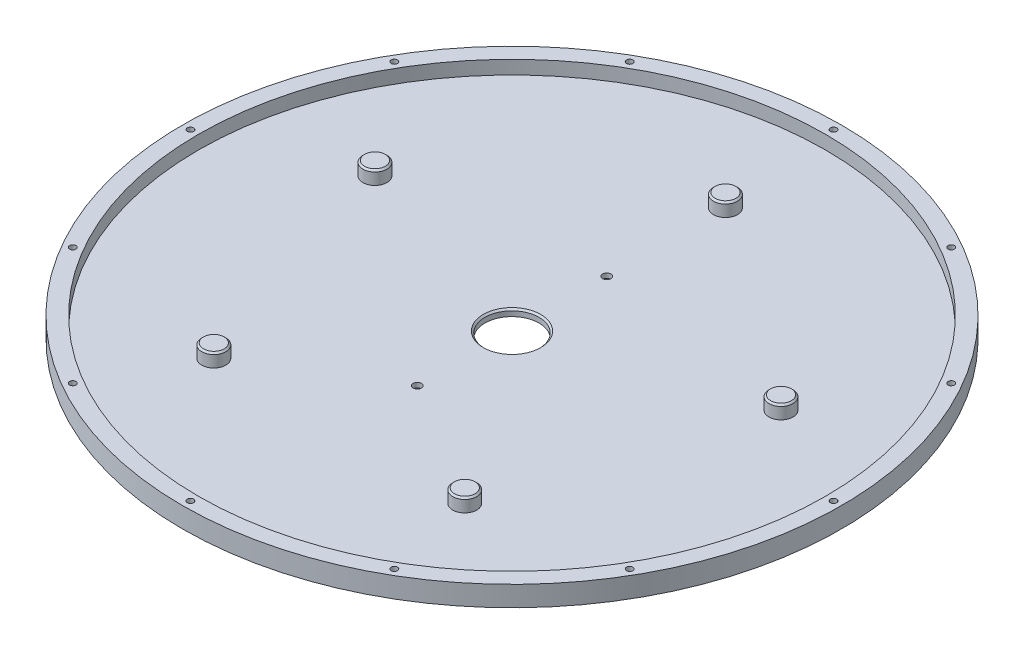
ISO-10303-21;
HEADER;
FILE_DESCRIPTION(('STEP AP214'),'2;1');
FILE_NAME('part.step','',(''),(''),'','','');
FILE_SCHEMA(('AUTOMOTIVE_DESIGN { 1 0 10303 214 1 1 1 1 }'));
ENDSEC;
DATA;
#1=APPLICATION_CONTEXT('core data for automotive mechanical design processes');
#2=APPLICATION_PROTOCOL_DEFINITION('international standard','automotive_design',2000,#1);
#3=PRODUCT_CONTEXT('',#1,'mechanical');
#4=PRODUCT('Part','Part','',(#3));
#5=PRODUCT_RELATED_PRODUCT_CATEGORY('part','',(#4));
#6=PRODUCT_DEFINITION_FORMATION('','',#4);
#7=PRODUCT_DEFINITION_CONTEXT('part definition',#1,'design');
#8=PRODUCT_DEFINITION('design','',#6,#7);
#9=PRODUCT_DEFINITION_SHAPE('','',#8);
#10=(LENGTH_UNIT() NAMED_UNIT(*) SI_UNIT(.MILLI.,.METRE.));
#11=(NAMED_UNIT(*) PLANE_ANGLE_UNIT() SI_UNIT($,.RADIAN.));
#12=(NAMED_UNIT(*) SI_UNIT($,.STERADIAN.) SOLID_ANGLE_UNIT());
#13=UNCERTAINTY_MEASURE_WITH_UNIT(LENGTH_MEASURE(1.E-05),#10,'distance_accuracy_value','');
#14=(GEOMETRIC_REPRESENTATION_CONTEXT(3) GLOBAL_UNCERTAINTY_ASSIGNED_CONTEXT((#13)) GLOBAL_UNIT_ASSIGNED_CONTEXT((#10,
#11,#12)) REPRESENTATION_CONTEXT('',''));
#15=CARTESIAN_POINT('',(0.,0.,0.));
#16=DIRECTION('',(0.,0.,1.));
#17=DIRECTION('',(1.,0.,0.));
#18=AXIS2_PLACEMENT_3D('',#15,#16,#17);
#19=CARTESIAN_POINT('',(0.,-6.35,0.));
#20=DIRECTION('',(0.,-1.,0.));
#21=DIRECTION('',(0.,0.,-1.));
#22=AXIS2_PLACEMENT_3D('',#19,#20,#21);
#23=PLANE('',#22);
#24=CARTESIAN_POINT('',(0.,-6.34999999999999,-45.085));
#25=DIRECTION('',(0.,-1.,0.));
#26=DIRECTION('',(0.,0.,-1.));
#27=AXIS2_PLACEMENT_3D('',#24,#25,#26);
#28=CIRCLE('',#27,1.9685);
#29=CARTESIAN_POINT('',(0.,-6.34999999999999,-47.0535));
#30=VERTEX_POINT('',#29);
#31=EDGE_CURVE('E388',#30,#30,#28,.T.);
#32=ORIENTED_EDGE('',*,*,#31,.T.);
#33=EDGE_LOOP('',(#32));
#34=FACE_BOUND('',#33,.T.);
#35=CARTESIAN_POINT('',(0.,-6.35000000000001,45.085));
#36=DIRECTION('',(0.,-1.,0.));
#37=DIRECTION('',(0.,0.,-1.));
#38=AXIS2_PLACEMENT_3D('',#35,#36,#37);
#39=CIRCLE('',#38,1.9685);
#40=CARTESIAN_POINT('',(0.,-6.35000000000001,43.1165));
#41=VERTEX_POINT('',#40);
#42=EDGE_CURVE('E391',#41,#41,#39,.T.);
#43=ORIENTED_EDGE('',*,*,#42,.T.);
#44=EDGE_LOOP('',(#43));
#45=FACE_BOUND('',#44,.T.);
#46=CARTESIAN_POINT('',(0.,-6.35,0.));
#47=DIRECTION('',(0.,-1.,0.));
#48=DIRECTION('',(0.,0.,-1.));
#49=AXIS2_PLACEMENT_3D('',#46,#47,#48);
#50=CIRCLE('',#49,13.674725);
#51=CARTESIAN_POINT('',(0.,-6.35,-13.674725));
#52=VERTEX_POINT('',#51);
#53=EDGE_CURVE('E253',#52,#52,#50,.T.);
#54=ORIENTED_EDGE('',*,*,#53,.T.);
#55=EDGE_LOOP('',(#54));
#56=FACE_BOUND('',#55,.T.);
#57=CARTESIAN_POINT('',(-96.6273420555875,-6.34999999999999,-31.3961266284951));
#58=DIRECTION('',(0.,-1.,0.));
#59=DIRECTION('',(0.,0.,-1.));
#60=AXIS2_PLACEMENT_3D('',#57,#58,#59);
#61=CIRCLE('',#60,5.71499999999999);
#62=CARTESIAN_POINT('',(-96.6273420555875,-6.34999999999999,-37.111126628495));
#63=VERTEX_POINT('',#62);
#64=EDGE_CURVE('E301',#63,#63,#61,.T.);
#65=ORIENTED_EDGE('',*,*,#64,.T.);
#66=EDGE_LOOP('',(#65));
#67=FACE_BOUND('',#66,.T.);
#68=CARTESIAN_POINT('',(-59.718981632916,-6.35000000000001,82.1961266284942));
#69=DIRECTION('',(0.,-1.,0.));
#70=DIRECTION('',(0.,0.,-1.));
#71=AXIS2_PLACEMENT_3D('',#68,#69,#70);
#72=CIRCLE('',#71,5.715);
#73=CARTESIAN_POINT('',(-59.718981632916,-6.35000000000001,76.4811266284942));
#74=VERTEX_POINT('',#73);
#75=EDGE_CURVE('E298',#74,#74,#72,.F.);
#76=ORIENTED_EDGE('',*,*,#75,.F.);
#77=EDGE_LOOP('',(#76));
#78=FACE_BOUND('',#77,.T.);
#79=CARTESIAN_POINT('',(59.7189816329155,-6.35000000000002,82.1961266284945));
#80=DIRECTION('',(0.,-1.,0.));
#81=DIRECTION('',(0.,0.,-1.));
#82=AXIS2_PLACEMENT_3D('',#79,#80,#81);
#83=CIRCLE('',#82,5.715);
#84=CARTESIAN_POINT('',(59.7189816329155,-6.35000000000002,76.4811266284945));
#85=VERTEX_POINT('',#84);
#86=EDGE_CURVE('E295',#85,#85,#83,.F.);
#87=ORIENTED_EDGE('',*,*,#86,.F.);
#88=EDGE_LOOP('',(#87));
#89=FACE_BOUND('',#88,.T.);
#90=CARTESIAN_POINT('',(96.6273420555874,-6.35,-31.3961266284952));
#91=DIRECTION('',(0.,-1.,0.));
#92=DIRECTION('',(0.,0.,-1.));
#93=AXIS2_PLACEMENT_3D('',#90,#91,#92);
#94=CIRCLE('',#93,5.71499999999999);
#95=CARTESIAN_POINT('',(96.6273420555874,-6.35,-37.1111266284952));
#96=VERTEX_POINT('',#95);
#97=EDGE_CURVE('E292',#96,#96,#94,.F.);
#98=ORIENTED_EDGE('',*,*,#97,.F.);
#99=EDGE_LOOP('',(#98));
#100=FACE_BOUND('',#99,.T.);
#101=CARTESIAN_POINT('',(0.,-6.34999999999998,-101.6));
#102=DIRECTION('',(0.,-1.,0.));
#103=DIRECTION('',(0.,0.,-1.));
#104=AXIS2_PLACEMENT_3D('',#101,#102,#103);
#105=CIRCLE('',#104,5.715);
#106=CARTESIAN_POINT('',(0.,-6.34999999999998,-107.315));
#107=VERTEX_POINT('',#106);
#108=EDGE_CURVE('E289',#107,#107,#105,.F.);
#109=ORIENTED_EDGE('',*,*,#108,.F.);
#110=EDGE_LOOP('',(#109));
#111=FACE_BOUND('',#110,.T.);
#112=CARTESIAN_POINT('',(0.,-6.35,0.));
#113=DIRECTION('',(0.,-1.,0.));
#114=DIRECTION('',(0.,0.,-1.));
#115=AXIS2_PLACEMENT_3D('',#112,#113,#114);
#116=CIRCLE('',#115,149.225);
#117=CARTESIAN_POINT('',(0.,-6.34999999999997,-149.225));
#118=VERTEX_POINT('',#117);
#119=EDGE_CURVE('E286',#118,#118,#116,.T.);
#120=ORIENTED_EDGE('',*,*,#119,.F.);
#121=EDGE_LOOP('',(#120));
#122=FACE_BOUND('',#121,.T.);
#123=ADVANCED_FACE('F229',(#34,#45,#56,#67,#78,#89,#100,#111,#122),#23,.F.);
#124=CARTESIAN_POINT('',(-96.6273420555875,-6.34999999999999,-31.3961266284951));
#125=DIRECTION('',(0.,1.,0.));
#126=DIRECTION('',(0.,0.,1.));
#127=AXIS2_PLACEMENT_3D('',#124,#125,#126);
#128=CYLINDRICAL_SURFACE('',#127,5.71499999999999);
#129=CARTESIAN_POINT('',(-96.6273420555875,-0.793750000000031,-31.3961266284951));
#130=DIRECTION('',(0.,-1.,0.));
#131=DIRECTION('',(0.,0.,-1.));
#132=AXIS2_PLACEMENT_3D('',#129,#130,#131);
#133=CIRCLE('',#132,5.71499999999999);
#134=CARTESIAN_POINT('',(-96.6273420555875,-0.793750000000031,-37.111126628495));
#135=VERTEX_POINT('',#134);
#136=EDGE_CURVE('E277',#135,#135,#133,.T.);
#137=ORIENTED_EDGE('',*,*,#136,.T.);
#138=EDGE_LOOP('',(#137));
#139=FACE_BOUND('',#138,.T.);
#140=ORIENTED_EDGE('',*,*,#64,.F.);
#141=EDGE_LOOP('',(#140));
#142=FACE_BOUND('',#141,.T.);
#143=ADVANCED_FACE('F415',(#139,#142),#128,.T.);
#144=CARTESIAN_POINT('',(-96.6273420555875,0.,-31.3961266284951));
#145=DIRECTION('',(0.,-1.,0.));
#146=DIRECTION('',(0.,0.,-1.));
#147=AXIS2_PLACEMENT_3D('',#144,#145,#146);
#148=PLANE('',#147);
#149=CARTESIAN_POINT('',(-96.6273420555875,0.,-31.3961266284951));
#150=DIRECTION('',(0.,-1.,0.));
#151=DIRECTION('',(0.,0.,-1.));
#152=AXIS2_PLACEMENT_3D('',#149,#150,#151);
#153=CIRCLE('',#152,4.92124999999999);
#154=CARTESIAN_POINT('',(-96.6273420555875,0.,-36.317376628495));
#155=VERTEX_POINT('',#154);
#156=EDGE_CURVE('E274',#155,#155,#153,.F.);
#157=ORIENTED_EDGE('',*,*,#156,.T.);
#158=EDGE_LOOP('',(#157));
#159=FACE_BOUND('',#158,.T.);
#160=ADVANCED_FACE('F421',(#159),#148,.F.);
#161=CARTESIAN_POINT('',(-59.718981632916,-6.35000000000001,82.1961266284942));
#162=DIRECTION('',(0.,1.,0.));
#163=DIRECTION('',(0.,0.,1.));
#164=AXIS2_PLACEMENT_3D('',#161,#162,#163);
#165=CYLINDRICAL_SURFACE('',#164,5.715);
#166=CARTESIAN_POINT('',(-59.718981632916,-0.793750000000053,82.1961266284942));
#167=DIRECTION('',(0.,-1.,0.));
#168=DIRECTION('',(0.,0.,-1.));
#169=AXIS2_PLACEMENT_3D('',#166,#167,#168);
#170=CIRCLE('',#169,5.715);
#171=CARTESIAN_POINT('',(-59.718981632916,-0.793750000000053,76.4811266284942));
#172=VERTEX_POINT('',#171);
#173=EDGE_CURVE('E271',#172,#172,#170,.T.);
#174=ORIENTED_EDGE('',*,*,#173,.T.);
#175=EDGE_LOOP('',(#174));
#176=FACE_BOUND('',#175,.T.);
#177=ORIENTED_EDGE('',*,*,#75,.T.);
#178=EDGE_LOOP('',(#177));
#179=FACE_BOUND('',#178,.T.);
#180=ADVANCED_FACE('F484',(#176,#179),#165,.T.);
#181=CARTESIAN_POINT('',(-59.718981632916,0.,82.1961266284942));
#182=DIRECTION('',(0.,-1.,0.));
#183=DIRECTION('',(0.,0.,-1.));
#184=AXIS2_PLACEMENT_3D('',#181,#182,#183);
#185=PLANE('',#184);
#186=CARTESIAN_POINT('',(-59.718981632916,0.,82.1961266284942));
#187=DIRECTION('',(0.,-1.,0.));
#188=DIRECTION('',(0.,0.,-1.));
#189=AXIS2_PLACEMENT_3D('',#186,#187,#188);
#190=CIRCLE('',#189,4.92124999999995);
#191=CARTESIAN_POINT('',(-59.718981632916,0.,77.2748766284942));
#192=VERTEX_POINT('',#191);
#193=EDGE_CURVE('E268',#192,#192,#190,.F.);
#194=ORIENTED_EDGE('',*,*,#193,.T.);
#195=EDGE_LOOP('',(#194));
#196=FACE_BOUND('',#195,.T.);
#197=ADVANCED_FACE('F600',(#196),#185,.F.);
#198=CARTESIAN_POINT('',(59.7189816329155,-6.35000000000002,82.1961266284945));
#199=DIRECTION('',(0.,1.,0.));
#200=DIRECTION('',(0.,0.,1.));
#201=AXIS2_PLACEMENT_3D('',#198,#199,#200);
#202=CYLINDRICAL_SURFACE('',#201,5.715);
#203=CARTESIAN_POINT('',(59.7189816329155,-0.793750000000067,82.1961266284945));
#204=DIRECTION('',(0.,-1.,0.));
#205=DIRECTION('',(0.,0.,-1.));
#206=AXIS2_PLACEMENT_3D('',#203,#204,#205);
#207=CIRCLE('',#206,5.715);
#208=CARTESIAN_POINT('',(59.7189816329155,-0.793750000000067,76.4811266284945));
#209=VERTEX_POINT('',#208);
#210=EDGE_CURVE('E265',#209,#209,#207,.T.);
#211=ORIENTED_EDGE('',*,*,#210,.T.);
#212=EDGE_LOOP('',(#211));
#213=FACE_BOUND('',#212,.T.);
#214=ORIENTED_EDGE('',*,*,#86,.T.);
#215=EDGE_LOOP('',(#214));
#216=FACE_BOUND('',#215,.T.);
#217=ADVANCED_FACE('F597',(#213,#216),#202,.T.);
#218=CARTESIAN_POINT('',(59.7189816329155,0.,82.1961266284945));
#219=DIRECTION('',(0.,-1.,0.));
#220=DIRECTION('',(0.,0.,-1.));
#221=AXIS2_PLACEMENT_3D('',#218,#219,#220);
#222=PLANE('',#221);
#223=CARTESIAN_POINT('',(59.7189816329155,0.,82.1961266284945));
#224=DIRECTION('',(0.,-1.,0.));
#225=DIRECTION('',(0.,0.,-1.));
#226=AXIS2_PLACEMENT_3D('',#223,#224,#225);
#227=CIRCLE('',#226,4.92124999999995);
#228=CARTESIAN_POINT('',(59.7189816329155,0.,77.2748766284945));
#229=VERTEX_POINT('',#228);
#230=EDGE_CURVE('E262',#229,#229,#227,.F.);
#231=ORIENTED_EDGE('',*,*,#230,.T.);
#232=EDGE_LOOP('',(#231));
#233=FACE_BOUND('',#232,.T.);
#234=ADVANCED_FACE('F592',(#233),#222,.F.);
#235=CARTESIAN_POINT('',(96.6273420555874,-6.35,-31.3961266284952));
#236=DIRECTION('',(0.,1.,0.));
#237=DIRECTION('',(0.,0.,1.));
#238=AXIS2_PLACEMENT_3D('',#235,#236,#237);
#239=CYLINDRICAL_SURFACE('',#238,5.71499999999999);
#240=CARTESIAN_POINT('',(96.6273420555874,-0.793750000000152,-31.3961266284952));
#241=DIRECTION('',(0.,-1.,0.));
#242=DIRECTION('',(0.,0.,-1.));
#243=AXIS2_PLACEMENT_3D('',#240,#241,#242);
#244=CIRCLE('',#243,5.71499999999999);
#245=CARTESIAN_POINT('',(96.6273420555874,-0.793750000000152,-37.1111266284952));
#246=VERTEX_POINT('',#245);
#247=EDGE_CURVE('E259',#246,#246,#244,.T.);
#248=ORIENTED_EDGE('',*,*,#247,.T.);
#249=EDGE_LOOP('',(#248));
#250=FACE_BOUND('',#249,.T.);
#251=ORIENTED_EDGE('',*,*,#97,.T.);
#252=EDGE_LOOP('',(#251));
#253=FACE_BOUND('',#252,.T.);
#254=ADVANCED_FACE('F589',(#250,#253),#239,.T.);
#255=CARTESIAN_POINT('',(96.6273420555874,0.,-31.3961266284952));
#256=DIRECTION('',(0.,-1.,0.));
#257=DIRECTION('',(0.,0.,-1.));
#258=AXIS2_PLACEMENT_3D('',#255,#256,#257);
#259=PLANE('',#258);
#260=CARTESIAN_POINT('',(96.6273420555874,0.,-31.3961266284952));
#261=DIRECTION('',(0.,-1.,0.));
#262=DIRECTION('',(0.,0.,-1.));
#263=AXIS2_PLACEMENT_3D('',#260,#261,#262);
#264=CIRCLE('',#263,4.92124999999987);
#265=CARTESIAN_POINT('',(96.6273420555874,0.,-36.3173766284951));
#266=VERTEX_POINT('',#265);
#267=EDGE_CURVE('E256',#266,#266,#264,.F.);
#268=ORIENTED_EDGE('',*,*,#267,.T.);
#269=EDGE_LOOP('',(#268));
#270=FACE_BOUND('',#269,.T.);
#271=ADVANCED_FACE('F587',(#270),#259,.F.);
#272=CARTESIAN_POINT('',(0.,-6.34999999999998,-101.6));
#273=DIRECTION('',(0.,1.,0.));
#274=DIRECTION('',(0.,0.,1.));
#275=AXIS2_PLACEMENT_3D('',#272,#273,#274);
#276=CYLINDRICAL_SURFACE('',#275,5.715);
#277=CARTESIAN_POINT('',(0.,-0.79375000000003,-101.6));
#278=DIRECTION('',(0.,-1.,0.));
#279=DIRECTION('',(1.,0.,0.));
#280=AXIS2_PLACEMENT_3D('',#277,#278,#279);
#281=CIRCLE('',#280,5.715);
#282=CARTESIAN_POINT('',(5.71500000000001,-0.79375000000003,-101.6));
#283=VERTEX_POINT('',#282);
#284=EDGE_CURVE('E283',#283,#283,#281,.T.);
#285=ORIENTED_EDGE('',*,*,#284,.T.);
#286=EDGE_LOOP('',(#285));
#287=FACE_BOUND('',#286,.T.);
#288=ORIENTED_EDGE('',*,*,#108,.T.);
#289=EDGE_LOOP('',(#288));
#290=FACE_BOUND('',#289,.T.);
#291=ADVANCED_FACE('F580',(#287,#290),#276,.T.);
#292=CARTESIAN_POINT('',(0.,0.,-101.6));
#293=DIRECTION('',(0.,-1.,0.));
#294=DIRECTION('',(0.,0.,-1.));
#295=AXIS2_PLACEMENT_3D('',#292,#293,#294);
#296=PLANE('',#295);
#297=CARTESIAN_POINT('',(0.,0.,-101.6));
#298=DIRECTION('',(0.,-1.,0.));
#299=DIRECTION('',(0.,0.,-1.));
#300=AXIS2_PLACEMENT_3D('',#297,#298,#299);
#301=CIRCLE('',#300,4.92124999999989);
#302=CARTESIAN_POINT('',(0.,0.,-106.52125));
#303=VERTEX_POINT('',#302);
#304=EDGE_CURVE('E280',#303,#303,#301,.F.);
#305=ORIENTED_EDGE('',*,*,#304,.T.);
#306=EDGE_LOOP('',(#305));
#307=FACE_BOUND('',#306,.T.);
#308=ADVANCED_FACE('F571',(#307),#296,.F.);
#309=CARTESIAN_POINT('',(0.,0.127,0.));
#310=DIRECTION('',(0.,-1.,0.));
#311=DIRECTION('',(0.,0.,-1.));
#312=AXIS2_PLACEMENT_3D('',#309,#310,#311);
#313=PLANE('',#312);
#314=CARTESIAN_POINT('',(76.5175,0.127000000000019,-132.532197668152));
#315=DIRECTION('',(0.,-1.,0.));
#316=DIRECTION('',(0.,0.,-1.));
#317=AXIS2_PLACEMENT_3D('',#314,#315,#316);
#318=CIRCLE('',#317,1.5);
#319=CARTESIAN_POINT('',(76.5175,0.127000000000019,-134.032197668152));
#320=VERTEX_POINT('',#319);
#321=EDGE_CURVE('E382',#320,#320,#318,.T.);
#322=ORIENTED_EDGE('',*,*,#321,.T.);
#323=EDGE_LOOP('',(#322));
#324=FACE_BOUND('',#323,.T.);
#325=CARTESIAN_POINT('',(132.532197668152,0.127000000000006,-76.5174999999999));
#326=DIRECTION('',(0.,-1.,0.));
#327=DIRECTION('',(0.,0.,-1.));
#328=AXIS2_PLACEMENT_3D('',#325,#326,#327);
#329=CIRCLE('',#328,1.5);
#330=CARTESIAN_POINT('',(132.532197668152,0.127000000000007,-78.0174999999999));
#331=VERTEX_POINT('',#330);
#332=EDGE_CURVE('E379',#331,#331,#329,.T.);
#333=ORIENTED_EDGE('',*,*,#332,.T.);
#334=EDGE_LOOP('',(#333));
#335=FACE_BOUND('',#334,.T.);
#336=CARTESIAN_POINT('',(153.035,0.126999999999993,0.));
#337=DIRECTION('',(0.,-1.,0.));
#338=DIRECTION('',(0.,0.,-1.));
#339=AXIS2_PLACEMENT_3D('',#336,#337,#338);
#340=CIRCLE('',#339,1.5);
#341=CARTESIAN_POINT('',(153.035,0.126999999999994,-1.49999999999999));
#342=VERTEX_POINT('',#341);
#343=EDGE_CURVE('E376',#342,#342,#340,.T.);
#344=ORIENTED_EDGE('',*,*,#343,.T.);
#345=EDGE_LOOP('',(#344));
#346=FACE_BOUND('',#345,.T.);
#347=CARTESIAN_POINT('',(132.532197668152,0.126999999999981,76.5175));
#348=DIRECTION('',(0.,-1.,0.));
#349=DIRECTION('',(0.,0.,-1.));
#350=AXIS2_PLACEMENT_3D('',#347,#348,#349);
#351=CIRCLE('',#350,1.5);
#352=CARTESIAN_POINT('',(132.532197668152,0.126999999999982,75.0175));
#353=VERTEX_POINT('',#352);
#354=EDGE_CURVE('E373',#353,#353,#351,.T.);
#355=ORIENTED_EDGE('',*,*,#354,.T.);
#356=EDGE_LOOP('',(#355));
#357=FACE_BOUND('',#356,.T.);
#358=CARTESIAN_POINT('',(76.5175,0.126999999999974,132.532197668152));
#359=DIRECTION('',(0.,-1.,0.));
#360=DIRECTION('',(0.,0.,-1.));
#361=AXIS2_PLACEMENT_3D('',#358,#359,#360);
#362=CIRCLE('',#361,1.5);
#363=CARTESIAN_POINT('',(76.5175,0.126999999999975,131.032197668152));
#364=VERTEX_POINT('',#363);
#365=EDGE_CURVE('E370',#364,#364,#362,.T.);
#366=ORIENTED_EDGE('',*,*,#365,.T.);
#367=EDGE_LOOP('',(#366));
#368=FACE_BOUND('',#367,.T.);
#369=CARTESIAN_POINT('',(0.,0.126999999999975,153.035));
#370=DIRECTION('',(0.,-1.,0.));
#371=DIRECTION('',(0.,0.,-1.));
#372=AXIS2_PLACEMENT_3D('',#369,#370,#371);
#373=CIRCLE('',#372,1.5);
#374=CARTESIAN_POINT('',(0.,0.126999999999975,151.535));
#375=VERTEX_POINT('',#374);
#376=EDGE_CURVE('E367',#375,#375,#373,.T.);
#377=ORIENTED_EDGE('',*,*,#376,.T.);
#378=EDGE_LOOP('',(#377));
#379=FACE_BOUND('',#378,.T.);
#380=CARTESIAN_POINT('',(-76.5175,0.126999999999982,132.532197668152));
#381=DIRECTION('',(0.,-1.,0.));
#382=DIRECTION('',(0.,0.,-1.));
#383=AXIS2_PLACEMENT_3D('',#380,#381,#382);
#384=CIRCLE('',#383,1.5);
#385=CARTESIAN_POINT('',(-76.5175,0.126999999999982,131.032197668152));
#386=VERTEX_POINT('',#385);
#387=EDGE_CURVE('E364',#386,#386,#384,.T.);
#388=ORIENTED_EDGE('',*,*,#387,.T.);
#389=EDGE_LOOP('',(#388));
#390=FACE_BOUND('',#389,.T.);
#391=CARTESIAN_POINT('',(-132.532197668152,0.126999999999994,76.5175));
#392=DIRECTION('',(0.,-1.,0.));
#393=DIRECTION('',(0.,0.,-1.));
#394=AXIS2_PLACEMENT_3D('',#391,#392,#393);
#395=CIRCLE('',#394,1.5);
#396=CARTESIAN_POINT('',(-132.532197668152,0.126999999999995,75.0175));
#397=VERTEX_POINT('',#396);
#398=EDGE_CURVE('E361',#397,#397,#395,.T.);
#399=ORIENTED_EDGE('',*,*,#398,.T.);
#400=EDGE_LOOP('',(#399));
#401=FACE_BOUND('',#400,.T.);
#402=CARTESIAN_POINT('',(-153.035,0.127000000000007,0.));
#403=DIRECTION('',(0.,-1.,0.));
#404=DIRECTION('',(0.,0.,-1.));
#405=AXIS2_PLACEMENT_3D('',#402,#403,#404);
#406=CIRCLE('',#405,1.5);
#407=CARTESIAN_POINT('',(-153.035,0.127000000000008,-1.49999999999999));
#408=VERTEX_POINT('',#407);
#409=EDGE_CURVE('E358',#408,#408,#406,.T.);
#410=ORIENTED_EDGE('',*,*,#409,.T.);
#411=EDGE_LOOP('',(#410));
#412=FACE_BOUND('',#411,.T.);
#413=CARTESIAN_POINT('',(-132.532197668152,0.127000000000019,-76.5175));
#414=DIRECTION('',(0.,-1.,0.));
#415=DIRECTION('',(0.,0.,-1.));
#416=AXIS2_PLACEMENT_3D('',#413,#414,#415);
#417=CIRCLE('',#416,1.5);
#418=CARTESIAN_POINT('',(-132.532197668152,0.12700000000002,-78.0175));
#419=VERTEX_POINT('',#418);
#420=EDGE_CURVE('E355',#419,#419,#417,.T.);
#421=ORIENTED_EDGE('',*,*,#420,.T.);
#422=EDGE_LOOP('',(#421));
#423=FACE_BOUND('',#422,.T.);
#424=CARTESIAN_POINT('',(-76.5175,0.127000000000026,-132.532197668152));
#425=DIRECTION('',(0.,-1.,0.));
#426=DIRECTION('',(0.,0.,-1.));
#427=AXIS2_PLACEMENT_3D('',#424,#425,#426);
#428=CIRCLE('',#427,1.5);
#429=CARTESIAN_POINT('',(-76.5175,0.127000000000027,-134.032197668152));
#430=VERTEX_POINT('',#429);
#431=EDGE_CURVE('E352',#430,#430,#428,.T.);
#432=ORIENTED_EDGE('',*,*,#431,.T.);
#433=EDGE_LOOP('',(#432));
#434=FACE_BOUND('',#433,.T.);
#435=CARTESIAN_POINT('',(0.,0.127000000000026,-153.035));
#436=DIRECTION('',(0.,-1.,0.));
#437=DIRECTION('',(0.,0.,-1.));
#438=AXIS2_PLACEMENT_3D('',#435,#436,#437);
#439=CIRCLE('',#438,1.5);
#440=CARTESIAN_POINT('',(0.,0.127000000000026,-154.535));
#441=VERTEX_POINT('',#440);
#442=EDGE_CURVE('E349',#441,#441,#439,.T.);
#443=ORIENTED_EDGE('',*,*,#442,.T.);
#444=EDGE_LOOP('',(#443));
#445=FACE_BOUND('',#444,.T.);
#446=CARTESIAN_POINT('',(0.,0.127,0.));
#447=DIRECTION('',(0.,-1.,0.));
#448=DIRECTION('',(0.,0.,-1.));
#449=AXIS2_PLACEMENT_3D('',#446,#447,#448);
#450=CIRCLE('',#449,149.225);
#451=CARTESIAN_POINT('',(0.,0.127000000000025,-149.225));
#452=VERTEX_POINT('',#451);
#453=EDGE_CURVE('E346',#452,#452,#450,.T.);
#454=ORIENTED_EDGE('',*,*,#453,.T.);
#455=EDGE_LOOP('',(#454));
#456=FACE_BOUND('',#455,.T.);
#457=CARTESIAN_POINT('',(0.,0.127,0.));
#458=DIRECTION('',(0.,-1.,0.));
#459=DIRECTION('',(0.,0.,-1.));
#460=AXIS2_PLACEMENT_3D('',#457,#458,#459);
#461=CIRCLE('',#460,156.845);
#462=CARTESIAN_POINT('',(0.,0.127000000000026,-156.845));
#463=VERTEX_POINT('',#462);
#464=EDGE_CURVE('E343',#463,#463,#461,.T.);
#465=ORIENTED_EDGE('',*,*,#464,.F.);
#466=EDGE_LOOP('',(#465));
#467=FACE_BOUND('',#466,.T.);
#468=ADVANCED_FACE('F569',(#324,#335,#346,#357,#368,#379,#390,#401,#412,#423,#434,#445,#456,
#467),#313,.F.);
#469=CARTESIAN_POINT('',(0.,0.127,0.));
#470=DIRECTION('',(0.,-1.,0.));
#471=DIRECTION('',(0.,0.,-1.));
#472=AXIS2_PLACEMENT_3D('',#469,#470,#471);
#473=CYLINDRICAL_SURFACE('',#472,149.225);
#474=ORIENTED_EDGE('',*,*,#453,.F.);
#475=EDGE_LOOP('',(#474));
#476=FACE_BOUND('',#475,.T.);
#477=ORIENTED_EDGE('',*,*,#119,.T.);
#478=EDGE_LOOP('',(#477));
#479=FACE_BOUND('',#478,.T.);
#480=ADVANCED_FACE('F432',(#476,#479),#473,.F.);
#481=CARTESIAN_POINT('',(0.,-9.525,0.));
#482=DIRECTION('',(0.,1.,0.));
#483=DIRECTION('',(0.,0.,1.));
#484=AXIS2_PLACEMENT_3D('',#481,#482,#483);
#485=CYLINDRICAL_SURFACE('',#484,156.845);
#486=CARTESIAN_POINT('',(0.,-9.525,0.));
#487=DIRECTION('',(0.,-1.,0.));
#488=DIRECTION('',(0.,0.,-1.));
#489=AXIS2_PLACEMENT_3D('',#486,#487,#488);
#490=CIRCLE('',#489,156.845);
#491=CARTESIAN_POINT('',(0.,-9.52499999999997,-156.845));
#492=VERTEX_POINT('',#491);
#493=EDGE_CURVE('E304',#492,#492,#490,.T.);
#494=ORIENTED_EDGE('',*,*,#493,.F.);
#495=EDGE_LOOP('',(#494));
#496=FACE_BOUND('',#495,.T.);
#497=ORIENTED_EDGE('',*,*,#464,.T.);
#498=EDGE_LOOP('',(#497));
#499=FACE_BOUND('',#498,.T.);
#500=ADVANCED_FACE('F428',(#496,#499),#485,.T.);
#501=CARTESIAN_POINT('',(0.,-9.52499999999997,-153.035));
#502=DIRECTION('',(0.,1.,0.));
#503=DIRECTION('',(0.,0.,1.));
#504=AXIS2_PLACEMENT_3D('',#501,#502,#503);
#505=CYLINDRICAL_SURFACE('',#504,1.5);
#506=CARTESIAN_POINT('',(0.,-9.52499999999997,-153.035));
#507=DIRECTION('',(0.,-1.,0.));
#508=DIRECTION('',(0.,0.,-1.));
#509=AXIS2_PLACEMENT_3D('',#506,#507,#508);
#510=CIRCLE('',#509,1.5);
#511=CARTESIAN_POINT('',(0.,-9.52499999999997,-154.535));
#512=VERTEX_POINT('',#511);
#513=EDGE_CURVE('E307',#512,#512,#510,.T.);
#514=ORIENTED_EDGE('',*,*,#513,.T.);
#515=EDGE_LOOP('',(#514));
#516=FACE_BOUND('',#515,.T.);
#517=ORIENTED_EDGE('',*,*,#442,.F.);
#518=EDGE_LOOP('',(#517));
#519=FACE_BOUND('',#518,.T.);
#520=ADVANCED_FACE('F431',(#516,#519),#505,.F.);
#521=CARTESIAN_POINT('',(-76.5175,-9.52499999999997,-132.532197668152));
#522=DIRECTION('',(0.,1.,0.));
#523=DIRECTION('',(0.,0.,1.));
#524=AXIS2_PLACEMENT_3D('',#521,#522,#523);
#525=CYLINDRICAL_SURFACE('',#524,1.5);
#526=CARTESIAN_POINT('',(-76.5175,-9.52499999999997,-132.532197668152));
#527=DIRECTION('',(0.,-1.,0.));
#528=DIRECTION('',(0.,0.,-1.));
#529=AXIS2_PLACEMENT_3D('',#526,#527,#528);
#530=CIRCLE('',#529,1.5);
#531=CARTESIAN_POINT('',(-76.5175,-9.52499999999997,-134.032197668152));
#532=VERTEX_POINT('',#531);
#533=EDGE_CURVE('E310',#532,#532,#530,.T.);
#534=ORIENTED_EDGE('',*,*,#533,.T.);
#535=EDGE_LOOP('',(#534));
#536=FACE_BOUND('',#535,.T.);
#537=ORIENTED_EDGE('',*,*,#431,.F.);
#538=EDGE_LOOP('',(#537));
#539=FACE_BOUND('',#538,.T.);
#540=ADVANCED_FACE('F436',(#536,#539),#525,.F.);
#541=CARTESIAN_POINT('',(-132.532197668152,-9.52499999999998,-76.5175));
#542=DIRECTION('',(0.,1.,0.));
#543=DIRECTION('',(0.,0.,1.));
#544=AXIS2_PLACEMENT_3D('',#541,#542,#543);
#545=CYLINDRICAL_SURFACE('',#544,1.5);
#546=CARTESIAN_POINT('',(-132.532197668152,-9.52499999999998,-76.5175));
#547=DIRECTION('',(0.,-1.,0.));
#548=DIRECTION('',(0.,0.,-1.));
#549=AXIS2_PLACEMENT_3D('',#546,#547,#548);
#550=CIRCLE('',#549,1.5);
#551=CARTESIAN_POINT('',(-132.532197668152,-9.52499999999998,-78.0175));
#552=VERTEX_POINT('',#551);
#553=EDGE_CURVE('E313',#552,#552,#550,.T.);
#554=ORIENTED_EDGE('',*,*,#553,.T.);
#555=EDGE_LOOP('',(#554));
#556=FACE_BOUND('',#555,.T.);
#557=ORIENTED_EDGE('',*,*,#420,.F.);
#558=EDGE_LOOP('',(#557));
#559=FACE_BOUND('',#558,.T.);
#560=ADVANCED_FACE('F440',(#556,#559),#545,.F.);
#561=CARTESIAN_POINT('',(-153.035,-9.52499999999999,0.));
#562=DIRECTION('',(0.,1.,0.));
#563=DIRECTION('',(0.,0.,1.));
#564=AXIS2_PLACEMENT_3D('',#561,#562,#563);
#565=CYLINDRICAL_SURFACE('',#564,1.5);
#566=CARTESIAN_POINT('',(-153.035,-9.52499999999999,0.));
#567=DIRECTION('',(0.,-1.,0.));
#568=DIRECTION('',(0.,0.,-1.));
#569=AXIS2_PLACEMENT_3D('',#566,#567,#568);
#570=CIRCLE('',#569,1.5);
#571=CARTESIAN_POINT('',(-153.035,-9.52499999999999,-1.49999999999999));
#572=VERTEX_POINT('',#571);
#573=EDGE_CURVE('E316',#572,#572,#570,.T.);
#574=ORIENTED_EDGE('',*,*,#573,.T.);
#575=EDGE_LOOP('',(#574));
#576=FACE_BOUND('',#575,.T.);
#577=ORIENTED_EDGE('',*,*,#409,.F.);
#578=EDGE_LOOP('',(#577));
#579=FACE_BOUND('',#578,.T.);
#580=ADVANCED_FACE('F444',(#576,#579),#565,.F.);
#581=CARTESIAN_POINT('',(-132.532197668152,-9.52500000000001,76.5175));
#582=DIRECTION('',(0.,1.,0.));
#583=DIRECTION('',(0.,0.,1.));
#584=AXIS2_PLACEMENT_3D('',#581,#582,#583);
#585=CYLINDRICAL_SURFACE('',#584,1.5);
#586=CARTESIAN_POINT('',(-132.532197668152,-9.52500000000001,76.5175));
#587=DIRECTION('',(0.,-1.,0.));
#588=DIRECTION('',(0.,0.,-1.));
#589=AXIS2_PLACEMENT_3D('',#586,#587,#588);
#590=CIRCLE('',#589,1.5);
#591=CARTESIAN_POINT('',(-132.532197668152,-9.52500000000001,75.0175));
#592=VERTEX_POINT('',#591);
#593=EDGE_CURVE('E319',#592,#592,#590,.T.);
#594=ORIENTED_EDGE('',*,*,#593,.T.);
#595=EDGE_LOOP('',(#594));
#596=FACE_BOUND('',#595,.T.);
#597=ORIENTED_EDGE('',*,*,#398,.F.);
#598=EDGE_LOOP('',(#597));
#599=FACE_BOUND('',#598,.T.);
#600=ADVANCED_FACE('F448',(#596,#599),#585,.F.);
#601=CARTESIAN_POINT('',(-76.5175,-9.52500000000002,132.532197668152));
#602=DIRECTION('',(0.,1.,0.));
#603=DIRECTION('',(0.,0.,1.));
#604=AXIS2_PLACEMENT_3D('',#601,#602,#603);
#605=CYLINDRICAL_SURFACE('',#604,1.5);
#606=CARTESIAN_POINT('',(-76.5175,-9.52500000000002,132.532197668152));
#607=DIRECTION('',(0.,-1.,0.));
#608=DIRECTION('',(0.,0.,-1.));
#609=AXIS2_PLACEMENT_3D('',#606,#607,#608);
#610=CIRCLE('',#609,1.5);
#611=CARTESIAN_POINT('',(-76.5175,-9.52500000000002,131.032197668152));
#612=VERTEX_POINT('',#611);
#613=EDGE_CURVE('E322',#612,#612,#610,.T.);
#614=ORIENTED_EDGE('',*,*,#613,.T.);
#615=EDGE_LOOP('',(#614));
#616=FACE_BOUND('',#615,.T.);
#617=ORIENTED_EDGE('',*,*,#387,.F.);
#618=EDGE_LOOP('',(#617));
#619=FACE_BOUND('',#618,.T.);
#620=ADVANCED_FACE('F452',(#616,#619),#605,.F.);
#621=CARTESIAN_POINT('',(0.,-9.52500000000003,153.035));
#622=DIRECTION('',(0.,1.,0.));
#623=DIRECTION('',(0.,0.,1.));
#624=AXIS2_PLACEMENT_3D('',#621,#622,#623);
#625=CYLINDRICAL_SURFACE('',#624,1.5);
#626=CARTESIAN_POINT('',(0.,-9.52500000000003,153.035));
#627=DIRECTION('',(0.,-1.,0.));
#628=DIRECTION('',(0.,0.,-1.));
#629=AXIS2_PLACEMENT_3D('',#626,#627,#628);
#630=CIRCLE('',#629,1.5);
#631=CARTESIAN_POINT('',(0.,-9.52500000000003,151.535));
#632=VERTEX_POINT('',#631);
#633=EDGE_CURVE('E325',#632,#632,#630,.T.);
#634=ORIENTED_EDGE('',*,*,#633,.T.);
#635=EDGE_LOOP('',(#634));
#636=FACE_BOUND('',#635,.T.);
#637=ORIENTED_EDGE('',*,*,#376,.F.);
#638=EDGE_LOOP('',(#637));
#639=FACE_BOUND('',#638,.T.);
#640=ADVANCED_FACE('F456',(#636,#639),#625,.F.);
#641=CARTESIAN_POINT('',(76.5175,-9.52500000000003,132.532197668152));
#642=DIRECTION('',(0.,1.,0.));
#643=DIRECTION('',(0.,0.,1.));
#644=AXIS2_PLACEMENT_3D('',#641,#642,#643);
#645=CYLINDRICAL_SURFACE('',#644,1.5);
#646=CARTESIAN_POINT('',(76.5175,-9.52500000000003,132.532197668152));
#647=DIRECTION('',(0.,-1.,0.));
#648=DIRECTION('',(0.,0.,-1.));
#649=AXIS2_PLACEMENT_3D('',#646,#647,#648);
#650=CIRCLE('',#649,1.5);
#651=CARTESIAN_POINT('',(76.5175,-9.52500000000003,131.032197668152));
#652=VERTEX_POINT('',#651);
#653=EDGE_CURVE('E328',#652,#652,#650,.T.);
#654=ORIENTED_EDGE('',*,*,#653,.T.);
#655=EDGE_LOOP('',(#654));
#656=FACE_BOUND('',#655,.T.);
#657=ORIENTED_EDGE('',*,*,#365,.F.);
#658=EDGE_LOOP('',(#657));
#659=FACE_BOUND('',#658,.T.);
#660=ADVANCED_FACE('F460',(#656,#659),#645,.F.);
#661=CARTESIAN_POINT('',(132.532197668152,-9.52500000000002,76.5175));
#662=DIRECTION('',(0.,1.,0.));
#663=DIRECTION('',(0.,0.,1.));
#664=AXIS2_PLACEMENT_3D('',#661,#662,#663);
#665=CYLINDRICAL_SURFACE('',#664,1.5);
#666=CARTESIAN_POINT('',(132.532197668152,-9.52500000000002,76.5175));
#667=DIRECTION('',(0.,-1.,0.));
#668=DIRECTION('',(0.,0.,-1.));
#669=AXIS2_PLACEMENT_3D('',#666,#667,#668);
#670=CIRCLE('',#669,1.5);
#671=CARTESIAN_POINT('',(132.532197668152,-9.52500000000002,75.0175));
#672=VERTEX_POINT('',#671);
#673=EDGE_CURVE('E331',#672,#672,#670,.T.);
#674=ORIENTED_EDGE('',*,*,#673,.T.);
#675=EDGE_LOOP('',(#674));
#676=FACE_BOUND('',#675,.T.);
#677=ORIENTED_EDGE('',*,*,#354,.F.);
#678=EDGE_LOOP('',(#677));
#679=FACE_BOUND('',#678,.T.);
#680=ADVANCED_FACE('F464',(#676,#679),#665,.F.);
#681=CARTESIAN_POINT('',(153.035,-9.52500000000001,0.));
#682=DIRECTION('',(0.,1.,0.));
#683=DIRECTION('',(0.,0.,1.));
#684=AXIS2_PLACEMENT_3D('',#681,#682,#683);
#685=CYLINDRICAL_SURFACE('',#684,1.5);
#686=CARTESIAN_POINT('',(153.035,-9.52500000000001,0.));
#687=DIRECTION('',(0.,-1.,0.));
#688=DIRECTION('',(0.,0.,-1.));
#689=AXIS2_PLACEMENT_3D('',#686,#687,#688);
#690=CIRCLE('',#689,1.5);
#691=CARTESIAN_POINT('',(153.035,-9.52500000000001,-1.49999999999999));
#692=VERTEX_POINT('',#691);
#693=EDGE_CURVE('E334',#692,#692,#690,.T.);
#694=ORIENTED_EDGE('',*,*,#693,.T.);
#695=EDGE_LOOP('',(#694));
#696=FACE_BOUND('',#695,.T.);
#697=ORIENTED_EDGE('',*,*,#343,.F.);
#698=EDGE_LOOP('',(#697));
#699=FACE_BOUND('',#698,.T.);
#700=ADVANCED_FACE('F468',(#696,#699),#685,.F.);
#701=CARTESIAN_POINT('',(132.532197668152,-9.52499999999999,-76.5174999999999));
#702=DIRECTION('',(0.,1.,0.));
#703=DIRECTION('',(0.,0.,1.));
#704=AXIS2_PLACEMENT_3D('',#701,#702,#703);
#705=CYLINDRICAL_SURFACE('',#704,1.5);
#706=CARTESIAN_POINT('',(132.532197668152,-9.52499999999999,-76.5174999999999));
#707=DIRECTION('',(0.,-1.,0.));
#708=DIRECTION('',(0.,0.,-1.));
#709=AXIS2_PLACEMENT_3D('',#706,#707,#708);
#710=CIRCLE('',#709,1.5);
#711=CARTESIAN_POINT('',(132.532197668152,-9.52499999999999,-78.0174999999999));
#712=VERTEX_POINT('',#711);
#713=EDGE_CURVE('E337',#712,#712,#710,.T.);
#714=ORIENTED_EDGE('',*,*,#713,.T.);
#715=EDGE_LOOP('',(#714));
#716=FACE_BOUND('',#715,.T.);
#717=ORIENTED_EDGE('',*,*,#332,.F.);
#718=EDGE_LOOP('',(#717));
#719=FACE_BOUND('',#718,.T.);
#720=ADVANCED_FACE('F472',(#716,#719),#705,.F.);
#721=CARTESIAN_POINT('',(0.,-9.525,0.));
#722=DIRECTION('',(0.,-1.,0.));
#723=DIRECTION('',(0.,0.,-1.));
#724=AXIS2_PLACEMENT_3D('',#721,#722,#723);
#725=PLANE('',#724);
#726=CARTESIAN_POINT('',(0.,-9.52500000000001,45.085));
#727=DIRECTION('',(0.,-1.,0.));
#728=DIRECTION('',(0.,0.,-1.));
#729=AXIS2_PLACEMENT_3D('',#726,#727,#728);
#730=CIRCLE('',#729,2.88607499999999);
#731=CARTESIAN_POINT('',(0.,-9.52500000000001,42.198925));
#732=VERTEX_POINT('',#731);
#733=EDGE_CURVE('E237',#732,#732,#730,.F.);
#734=ORIENTED_EDGE('',*,*,#733,.T.);
#735=EDGE_LOOP('',(#734));
#736=FACE_BOUND('',#735,.T.);
#737=CARTESIAN_POINT('',(0.,-9.52499999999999,-45.085));
#738=DIRECTION('',(0.,-1.,0.));
#739=DIRECTION('',(0.,0.,-1.));
#740=AXIS2_PLACEMENT_3D('',#737,#738,#739);
#741=CIRCLE('',#740,2.88607499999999);
#742=CARTESIAN_POINT('',(0.,-9.52499999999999,-47.971075));
#743=VERTEX_POINT('',#742);
#744=EDGE_CURVE('E241',#743,#743,#741,.F.);
#745=ORIENTED_EDGE('',*,*,#744,.T.);
#746=EDGE_LOOP('',(#745));
#747=FACE_BOUND('',#746,.T.);
#748=CARTESIAN_POINT('',(0.,-9.525,0.));
#749=DIRECTION('',(0.,-1.,0.));
#750=DIRECTION('',(0.,0.,-1.));
#751=AXIS2_PLACEMENT_3D('',#748,#749,#750);
#752=CIRCLE('',#751,12.880975);
#753=CARTESIAN_POINT('',(0.,-9.525,-12.880975));
#754=VERTEX_POINT('',#753);
#755=EDGE_CURVE('E385',#754,#754,#752,.T.);
#756=ORIENTED_EDGE('',*,*,#755,.F.);
#757=EDGE_LOOP('',(#756));
#758=FACE_BOUND('',#757,.T.);
#759=CARTESIAN_POINT('',(76.5175,-9.52499999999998,-132.532197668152));
#760=DIRECTION('',(0.,-1.,0.));
#761=DIRECTION('',(0.,0.,-1.));
#762=AXIS2_PLACEMENT_3D('',#759,#760,#761);
#763=CIRCLE('',#762,1.5);
#764=CARTESIAN_POINT('',(76.5175,-9.52499999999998,-134.032197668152));
#765=VERTEX_POINT('',#764);
#766=EDGE_CURVE('E340',#765,#765,#763,.T.);
#767=ORIENTED_EDGE('',*,*,#766,.F.);
#768=EDGE_LOOP('',(#767));
#769=FACE_BOUND('',#768,.T.);
#770=ORIENTED_EDGE('',*,*,#713,.F.);
#771=EDGE_LOOP('',(#770));
#772=FACE_BOUND('',#771,.T.);
#773=ORIENTED_EDGE('',*,*,#693,.F.);
#774=EDGE_LOOP('',(#773));
#775=FACE_BOUND('',#774,.T.);
#776=ORIENTED_EDGE('',*,*,#673,.F.);
#777=EDGE_LOOP('',(#776));
#778=FACE_BOUND('',#777,.T.);
#779=ORIENTED_EDGE('',*,*,#653,.F.);
#780=EDGE_LOOP('',(#779));
#781=FACE_BOUND('',#780,.T.);
#782=ORIENTED_EDGE('',*,*,#633,.F.);
#783=EDGE_LOOP('',(#782));
#784=FACE_BOUND('',#783,.T.);
#785=ORIENTED_EDGE('',*,*,#613,.F.);
#786=EDGE_LOOP('',(#785));
#787=FACE_BOUND('',#786,.T.);
#788=ORIENTED_EDGE('',*,*,#593,.F.);
#789=EDGE_LOOP('',(#788));
#790=FACE_BOUND('',#789,.T.);
#791=ORIENTED_EDGE('',*,*,#573,.F.);
#792=EDGE_LOOP('',(#791));
#793=FACE_BOUND('',#792,.T.);
#794=ORIENTED_EDGE('',*,*,#553,.F.);
#795=EDGE_LOOP('',(#794));
#796=FACE_BOUND('',#795,.T.);
#797=ORIENTED_EDGE('',*,*,#533,.F.);
#798=EDGE_LOOP('',(#797));
#799=FACE_BOUND('',#798,.T.);
#800=ORIENTED_EDGE('',*,*,#513,.F.);
#801=EDGE_LOOP('',(#800));
#802=FACE_BOUND('',#801,.T.);
#803=ORIENTED_EDGE('',*,*,#493,.T.);
#804=EDGE_LOOP('',(#803));
#805=FACE_BOUND('',#804,.T.);
#806=ADVANCED_FACE('F426',(#736,#747,#758,#769,#772,#775,#778,#781,#784,#787,#790,#793,#796,
#799,#802,#805),#725,.T.);
#807=CARTESIAN_POINT('',(76.5175,-9.52499999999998,-132.532197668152));
#808=DIRECTION('',(0.,1.,0.));
#809=DIRECTION('',(0.,0.,1.));
#810=AXIS2_PLACEMENT_3D('',#807,#808,#809);
#811=CYLINDRICAL_SURFACE('',#810,1.5);
#812=ORIENTED_EDGE('',*,*,#766,.T.);
#813=EDGE_LOOP('',(#812));
#814=FACE_BOUND('',#813,.T.);
#815=ORIENTED_EDGE('',*,*,#321,.F.);
#816=EDGE_LOOP('',(#815));
#817=FACE_BOUND('',#816,.T.);
#818=ADVANCED_FACE('F477',(#814,#817),#811,.F.);
#819=CARTESIAN_POINT('',(0.,16.002,0.));
#820=DIRECTION('',(0.,-1.,0.));
#821=DIRECTION('',(0.,0.,-1.));
#822=AXIS2_PLACEMENT_3D('',#819,#820,#821);
#823=CYLINDRICAL_SURFACE('',#822,12.880975);
#824=CARTESIAN_POINT('',(0.,-7.14374999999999,0.));
#825=DIRECTION('',(0.,-1.,0.));
#826=DIRECTION('',(0.,0.,-1.));
#827=AXIS2_PLACEMENT_3D('',#824,#825,#826);
#828=CIRCLE('',#827,12.880975);
#829=CARTESIAN_POINT('',(0.,-7.14374999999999,-12.880975));
#830=VERTEX_POINT('',#829);
#831=EDGE_CURVE('E250',#830,#830,#828,.F.);
#832=ORIENTED_EDGE('',*,*,#831,.T.);
#833=EDGE_LOOP('',(#832));
#834=FACE_BOUND('',#833,.T.);
#835=ORIENTED_EDGE('',*,*,#755,.T.);
#836=EDGE_LOOP('',(#835));
#837=FACE_BOUND('',#836,.T.);
#838=ADVANCED_FACE('F479',(#834,#837),#823,.F.);
#839=CARTESIAN_POINT('',(0.,-0.793750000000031,-101.6));
#840=DIRECTION('',(0.,-1.,0.));
#841=DIRECTION('',(1.,0.,0.));
#842=AXIS2_PLACEMENT_3D('',#839,#840,#841);
#843=CONICAL_SURFACE('',#842,5.715,0.785398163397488);
#844=ORIENTED_EDGE('',*,*,#304,.F.);
#845=EDGE_LOOP('',(#844));
#846=FACE_BOUND('',#845,.T.);
#847=ORIENTED_EDGE('',*,*,#284,.F.);
#848=EDGE_LOOP('',(#847));
#849=FACE_BOUND('',#848,.T.);
#850=ADVANCED_FACE('F487',(#846,#849),#843,.T.);
#851=CARTESIAN_POINT('',(-96.6273420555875,-0.793750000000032,-31.3961266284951));
#852=DIRECTION('',(0.,-1.,0.));
#853=DIRECTION('',(0.,0.,-1.));
#854=AXIS2_PLACEMENT_3D('',#851,#852,#853);
#855=CONICAL_SURFACE('',#854,5.71499999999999,0.785398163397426);
#856=ORIENTED_EDGE('',*,*,#156,.F.);
#857=EDGE_LOOP('',(#856));
#858=FACE_BOUND('',#857,.T.);
#859=ORIENTED_EDGE('',*,*,#136,.F.);
#860=EDGE_LOOP('',(#859));
#861=FACE_BOUND('',#860,.T.);
#862=ADVANCED_FACE('F493',(#858,#861),#855,.T.);
#863=CARTESIAN_POINT('',(-59.718981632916,-0.793750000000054,82.1961266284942));
#864=DIRECTION('',(0.,-1.,0.));
#865=DIRECTION('',(0.,0.,-1.));
#866=AXIS2_PLACEMENT_3D('',#863,#864,#865);
#867=CONICAL_SURFACE('',#866,5.715,0.785398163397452);
#868=ORIENTED_EDGE('',*,*,#193,.F.);
#869=EDGE_LOOP('',(#868));
#870=FACE_BOUND('',#869,.T.);
#871=ORIENTED_EDGE('',*,*,#173,.F.);
#872=EDGE_LOOP('',(#871));
#873=FACE_BOUND('',#872,.T.);
#874=ADVANCED_FACE('F500',(#870,#873),#867,.T.);
#875=CARTESIAN_POINT('',(59.7189816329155,-0.793750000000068,82.1961266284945));
#876=DIRECTION('',(0.,-1.,0.));
#877=DIRECTION('',(0.,0.,-1.));
#878=AXIS2_PLACEMENT_3D('',#875,#876,#877);
#879=CONICAL_SURFACE('',#878,5.715,0.785398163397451);
#880=CARTESIAN_POINT('',(59.7189816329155,0.,77.2748766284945));
#881=CARTESIAN_POINT('',(59.7189816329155,-0.0082682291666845,77.2666083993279));
#882=CARTESIAN_POINT('',(59.7189816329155,-0.0165364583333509,77.2583401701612));
#883=CARTESIAN_POINT('',(59.7189816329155,-0.0330729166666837,77.2418037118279));
#884=CARTESIAN_POINT('',(59.7189816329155,-0.0413411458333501,77.2335354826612));
#885=CARTESIAN_POINT('',(59.7189816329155,-0.0578776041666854,77.2169990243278));
#886=CARTESIAN_POINT('',(59.7189816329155,-0.0661458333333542,77.2087307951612));
#887=CARTESIAN_POINT('',(59.7189816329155,-0.0826822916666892,77.1921943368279));
#888=CARTESIAN_POINT('',(59.7189816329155,-0.0909505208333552,77.1839261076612));
#889=CARTESIAN_POINT('',(59.7189816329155,-0.107486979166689,77.1673896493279));
#890=CARTESIAN_POINT('',(59.7189816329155,-0.115755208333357,77.1591214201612));
#891=CARTESIAN_POINT('',(59.7189816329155,-0.132291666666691,77.1425849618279));
#892=CARTESIAN_POINT('',(59.7189816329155,-0.140559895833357,77.1343167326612));
#893=CARTESIAN_POINT('',(59.7189816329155,-0.157096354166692,77.1177802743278));
#894=CARTESIAN_POINT('',(59.7189816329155,-0.165364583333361,77.1095120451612));
#895=CARTESIAN_POINT('',(59.7189816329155,-0.181901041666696,77.0929755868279));
#896=CARTESIAN_POINT('',(59.7189816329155,-0.190169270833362,77.0847073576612));
#897=CARTESIAN_POINT('',(59.7189816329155,-0.206705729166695,77.0681708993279));
#898=CARTESIAN_POINT('',(59.7189816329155,-0.214973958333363,77.0599026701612));
#899=CARTESIAN_POINT('',(59.7189816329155,-0.231510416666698,77.0433662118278));
#900=CARTESIAN_POINT('',(59.7189816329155,-0.239778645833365,77.0350979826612));
#901=CARTESIAN_POINT('',(59.7189816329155,-0.256315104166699,77.0185615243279));
#902=CARTESIAN_POINT('',(59.7189816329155,-0.264583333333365,77.0102932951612));
#903=CARTESIAN_POINT('',(59.7189816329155,-0.2811197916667,76.9937568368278));
#904=CARTESIAN_POINT('',(59.7189816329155,-0.289388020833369,76.9854886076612));
#905=CARTESIAN_POINT('',(59.7189816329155,-0.305924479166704,76.9689521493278));
#906=CARTESIAN_POINT('',(59.7189816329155,-0.31419270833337,76.9606839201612));
#907=CARTESIAN_POINT('',(59.7189816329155,-0.330729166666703,76.9441474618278));
#908=CARTESIAN_POINT('',(59.7189816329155,-0.338997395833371,76.9358792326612));
#909=CARTESIAN_POINT('',(59.7189816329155,-0.355533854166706,76.9193427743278));
#910=CARTESIAN_POINT('',(59.7189816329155,-0.363802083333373,76.9110745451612));
#911=CARTESIAN_POINT('',(59.7189816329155,-0.380338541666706,76.8945380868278));
#912=CARTESIAN_POINT('',(59.7189816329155,-0.388606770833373,76.8862698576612));
#913=CARTESIAN_POINT('',(59.7189816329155,-0.405143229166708,76.8697333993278));
#914=CARTESIAN_POINT('',(59.7189816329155,-0.413411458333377,76.8614651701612));
#915=CARTESIAN_POINT('',(59.7189816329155,-0.429947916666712,76.8449287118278));
#916=CARTESIAN_POINT('',(59.7189816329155,-0.438216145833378,76.8366604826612));
#917=CARTESIAN_POINT('',(59.7189816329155,-0.454752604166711,76.8201240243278));
#918=CARTESIAN_POINT('',(59.7189816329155,-0.463020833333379,76.8118557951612));
#919=CARTESIAN_POINT('',(59.7189816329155,-0.479557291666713,76.7953193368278));
#920=CARTESIAN_POINT('',(59.7189816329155,-0.487825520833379,76.7870511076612));
#921=CARTESIAN_POINT('',(59.7189816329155,-0.504361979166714,76.7705146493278));
#922=CARTESIAN_POINT('',(59.7189816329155,-0.512630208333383,76.7622464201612));
#923=CARTESIAN_POINT('',(59.7189816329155,-0.529166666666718,76.7457099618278));
#924=CARTESIAN_POINT('',(59.7189816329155,-0.537434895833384,76.7374417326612));
#925=CARTESIAN_POINT('',(59.7189816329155,-0.553971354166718,76.7209052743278));
#926=CARTESIAN_POINT('',(59.7189816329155,-0.562239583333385,76.7126370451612));
#927=CARTESIAN_POINT('',(59.7189816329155,-0.57877604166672,76.6961005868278));
#928=CARTESIAN_POINT('',(59.7189816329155,-0.587044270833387,76.6878323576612));
#929=CARTESIAN_POINT('',(59.7189816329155,-0.603580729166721,76.6712958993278));
#930=CARTESIAN_POINT('',(59.7189816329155,-0.611848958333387,76.6630276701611));
#931=CARTESIAN_POINT('',(59.7189816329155,-0.628385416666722,76.6464912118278));
#932=CARTESIAN_POINT('',(59.7189816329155,-0.636653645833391,76.6382229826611));
#933=CARTESIAN_POINT('',(59.7189816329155,-0.653190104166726,76.6216865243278));
#934=CARTESIAN_POINT('',(59.7189816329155,-0.661458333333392,76.6134182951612));
#935=CARTESIAN_POINT('',(59.7189816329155,-0.677994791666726,76.5968818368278));
#936=CARTESIAN_POINT('',(59.7189816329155,-0.686263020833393,76.5886136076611));
#937=CARTESIAN_POINT('',(59.7189816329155,-0.702799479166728,76.5720771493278));
#938=CARTESIAN_POINT('',(59.7189816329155,-0.711067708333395,76.5638089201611));
#939=CARTESIAN_POINT('',(59.7189816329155,-0.727604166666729,76.5472724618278));
#940=CARTESIAN_POINT('',(59.7189816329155,-0.735872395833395,76.5390042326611));
#941=CARTESIAN_POINT('',(59.7189816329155,-0.75240885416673,76.5224677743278));
#942=CARTESIAN_POINT('',(59.7189816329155,-0.760677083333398,76.5141995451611));
#943=CARTESIAN_POINT('',(59.7189816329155,-0.777213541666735,76.4976630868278));
#944=CARTESIAN_POINT('',(59.7189816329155,-0.785481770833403,76.4893948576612));
#945=CARTESIAN_POINT('',(59.7189816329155,-0.793750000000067,76.4811266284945));
#946=B_SPLINE_CURVE_WITH_KNOTS('',3,(#880,#881,#882,#883,#884,#885,#886,#887,#888,#889,#890,
#891,#892,#893,#894,#895,#896,#897,#898,#899,#900,#901,#902,#903,#904,#905,#906,#907,#908,#909,
#910,#911,#912,#913,#914,#915,#916,#917,#918,#919,#920,#921,#922,#923,#924,#925,#926,#927,#928,
#929,#930,#931,#932,#933,#934,#935,#936,#937,#938,#939,#940,#941,#942,#943,#944,#945),
.UNSPECIFIED.,.F.,.F.,(4,2,2,2,2,2,2,2,2,2,2,2,2,2,2,2,2,2,2,2,2,2,2,2,2,2,2,2,2,2,2,2,4),(0.,
0.0350791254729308,0.0701582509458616,0.105237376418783,0.140316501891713,0.175395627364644,
0.210474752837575,0.245553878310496,0.280633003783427,0.315712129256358,0.350791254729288,
0.385870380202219,0.42094950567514,0.456028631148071,0.491107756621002,0.526186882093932,
0.561266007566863,0.596345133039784,0.631424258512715,0.666503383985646,0.701582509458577,
0.736661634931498,0.771740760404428,0.806819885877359,0.84189901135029,0.876978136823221,
0.912057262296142,0.947136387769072,0.982215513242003,1.01729463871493,1.05237376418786,
1.08745288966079,1.12253201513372),.UNSPECIFIED.);
#947=EDGE_CURVE('BSEAM507',#229,#209,#946,.T.);
#948=ORIENTED_EDGE('',*,*,#230,.F.);
#949=ORIENTED_EDGE('',*,*,#210,.F.);
#950=ORIENTED_EDGE('',*,*,#947,.T.);
#951=ORIENTED_EDGE('',*,*,#947,.F.);
#952=EDGE_LOOP('',(#948,#950,#949,#951));
#953=FACE_BOUND('',#952,.T.);
#954=ADVANCED_FACE('F507',(#953),#879,.T.);
#955=CARTESIAN_POINT('',(96.6273420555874,-0.793750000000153,-31.3961266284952));
#956=DIRECTION('',(0.,-1.,0.));
#957=DIRECTION('',(0.,0.,-1.));
#958=AXIS2_PLACEMENT_3D('',#955,#956,#957);
#959=CONICAL_SURFACE('',#958,5.71499999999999,0.785398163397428);
#960=ORIENTED_EDGE('',*,*,#267,.F.);
#961=EDGE_LOOP('',(#960));
#962=FACE_BOUND('',#961,.T.);
#963=ORIENTED_EDGE('',*,*,#247,.F.);
#964=EDGE_LOOP('',(#963));
#965=FACE_BOUND('',#964,.T.);
#966=ADVANCED_FACE('F410',(#962,#965),#959,.T.);
#967=CARTESIAN_POINT('',(0.,-6.35,0.));
#968=DIRECTION('',(0.,1.,0.));
#969=DIRECTION('',(0.,0.,1.));
#970=AXIS2_PLACEMENT_3D('',#967,#968,#969);
#971=CONICAL_SURFACE('',#970,13.674725,0.785398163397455);
#972=ORIENTED_EDGE('',*,*,#831,.F.);
#973=EDGE_LOOP('',(#972));
#974=FACE_BOUND('',#973,.T.);
#975=ORIENTED_EDGE('',*,*,#53,.F.);
#976=EDGE_LOOP('',(#975));
#977=FACE_BOUND('',#976,.T.);
#978=ADVANCED_FACE('F400',(#974,#977),#971,.F.);
#979=CARTESIAN_POINT('',(0.,26.035,45.085));
#980=DIRECTION('',(0.,-1.,0.));
#981=DIRECTION('',(0.,0.,-1.));
#982=AXIS2_PLACEMENT_3D('',#979,#980,#981);
#983=CYLINDRICAL_SURFACE('',#982,1.9685);
#984=CARTESIAN_POINT('',(0.,-8.60742500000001,45.085));
#985=DIRECTION('',(0.,-1.,0.));
#986=DIRECTION('',(1.,0.,0.));
#987=AXIS2_PLACEMENT_3D('',#984,#985,#986);
#988=CIRCLE('',#987,1.9685);
#989=CARTESIAN_POINT('',(1.9685,-8.60742500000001,45.085));
#990=VERTEX_POINT('',#989);
#991=EDGE_CURVE('E245',#990,#990,#988,.T.);
#992=ORIENTED_EDGE('',*,*,#991,.T.);
#993=EDGE_LOOP('',(#992));
#994=FACE_BOUND('',#993,.T.);
#995=ORIENTED_EDGE('',*,*,#42,.F.);
#996=EDGE_LOOP('',(#995));
#997=FACE_BOUND('',#996,.T.);
#998=ADVANCED_FACE('F397',(#994,#997),#983,.F.);
#999=CARTESIAN_POINT('',(0.,26.035,-45.085));
#1000=DIRECTION('',(0.,-1.,0.));
#1001=DIRECTION('',(0.,0.,-1.));
#1002=AXIS2_PLACEMENT_3D('',#999,#1000,#1001);
#1003=CYLINDRICAL_SURFACE('',#1002,1.9685);
#1004=CARTESIAN_POINT('',(0.,-8.607425,-45.085));
#1005=DIRECTION('',(0.,-1.,0.));
#1006=DIRECTION('',(1.,0.,0.));
#1007=AXIS2_PLACEMENT_3D('',#1004,#1005,#1006);
#1008=CIRCLE('',#1007,1.9685);
#1009=CARTESIAN_POINT('',(1.9685,-8.607425,-45.085));
#1010=VERTEX_POINT('',#1009);
#1011=EDGE_CURVE('E11',#1010,#1010,#1008,.T.);
#1012=ORIENTED_EDGE('',*,*,#1011,.T.);
#1013=EDGE_LOOP('',(#1012));
#1014=FACE_BOUND('',#1013,.T.);
#1015=ORIENTED_EDGE('',*,*,#31,.F.);
#1016=EDGE_LOOP('',(#1015));
#1017=FACE_BOUND('',#1016,.T.);
#1018=ADVANCED_FACE('F399',(#1014,#1017),#1003,.F.);
#1019=CARTESIAN_POINT('',(0.,-8.60742500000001,45.085));
#1020=DIRECTION('',(0.,-1.,0.));
#1021=DIRECTION('',(1.,0.,0.));
#1022=AXIS2_PLACEMENT_3D('',#1019,#1020,#1021);
#1023=CONICAL_SURFACE('',#1022,1.9685,0.785398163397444);
#1024=ORIENTED_EDGE('',*,*,#733,.F.);
#1025=EDGE_LOOP('',(#1024));
#1026=FACE_BOUND('',#1025,.T.);
#1027=ORIENTED_EDGE('',*,*,#991,.F.);
#1028=EDGE_LOOP('',(#1027));
#1029=FACE_BOUND('',#1028,.T.);
#1030=ADVANCED_FACE('F407',(#1026,#1029),#1023,.F.);
#1031=CARTESIAN_POINT('',(0.,-8.607425,-45.085));
#1032=DIRECTION('',(0.,-1.,0.));
#1033=DIRECTION('',(1.,0.,0.));
#1034=AXIS2_PLACEMENT_3D('',#1031,#1032,#1033);
#1035=CONICAL_SURFACE('',#1034,1.9685,0.785398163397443);
#1036=ORIENTED_EDGE('',*,*,#744,.F.);
#1037=EDGE_LOOP('',(#1036));
#1038=FACE_BOUND('',#1037,.T.);
#1039=ORIENTED_EDGE('',*,*,#1011,.F.);
#1040=EDGE_LOOP('',(#1039));
#1041=FACE_BOUND('',#1040,.T.);
#1042=ADVANCED_FACE('F232',(#1038,#1041),#1035,.F.);
#1043=CLOSED_SHELL('',(#123,#143,#160,#180,#197,#217,#234,#254,#271,#291,#308,#468,#480,#500,
#520,#540,#560,#580,#600,#620,#640,#660,#680,#700,#720,#806,#818,#838,#850,#862,#874,#954,#966,
#978,#998,#1018,#1030,#1042));
#1044=MANIFOLD_SOLID_BREP('B2',#1043);
#1045=ADVANCED_BREP_SHAPE_REPRESENTATION('',(#18,#1044),#14);
#1046=SHAPE_DEFINITION_REPRESENTATION(#9,#1045);
ENDSEC;
END-ISO-10303-21;
